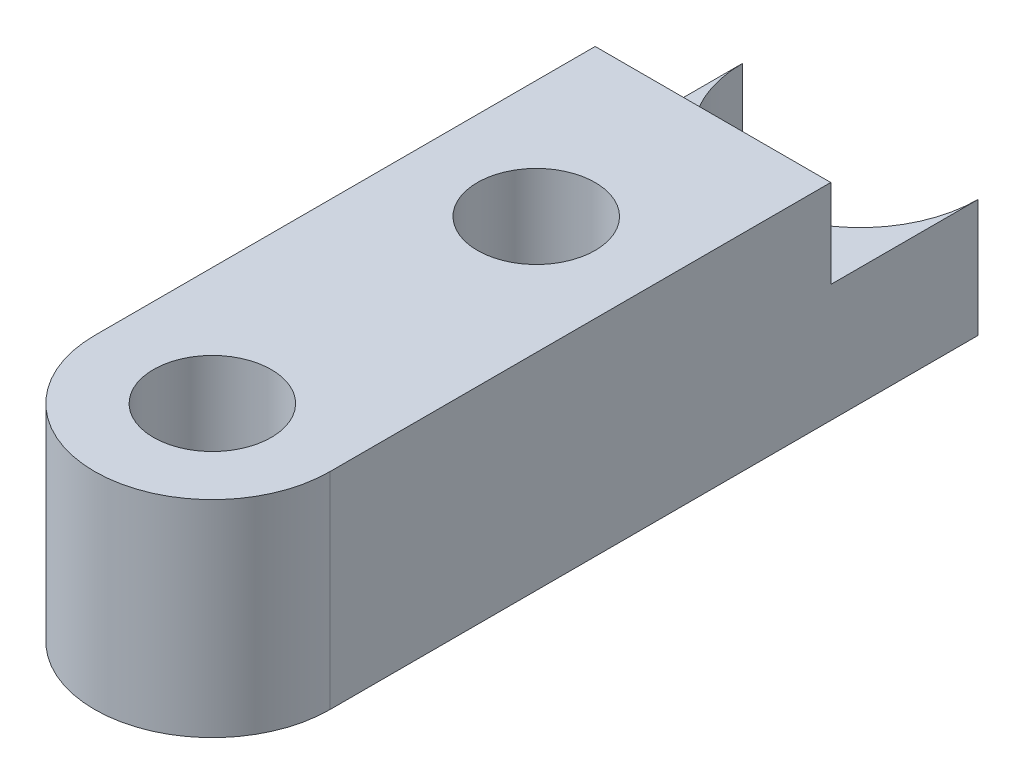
ISO-10303-21;
HEADER;
FILE_DESCRIPTION(('STEP AP214'),'2;1');
FILE_NAME('part.step','',(''),(''),'','','');
FILE_SCHEMA(('AUTOMOTIVE_DESIGN { 1 0 10303 214 1 1 1 1 }'));
ENDSEC;
DATA;
#1=APPLICATION_CONTEXT('core data for automotive mechanical design processes');
#2=APPLICATION_PROTOCOL_DEFINITION('international standard','automotive_design',2000,#1);
#3=PRODUCT_CONTEXT('',#1,'mechanical');
#4=PRODUCT('Part','Part','',(#3));
#5=PRODUCT_RELATED_PRODUCT_CATEGORY('part','',(#4));
#6=PRODUCT_DEFINITION_FORMATION('','',#4);
#7=PRODUCT_DEFINITION_CONTEXT('part definition',#1,'design');
#8=PRODUCT_DEFINITION('design','',#6,#7);
#9=PRODUCT_DEFINITION_SHAPE('','',#8);
#10=(LENGTH_UNIT() NAMED_UNIT(*) SI_UNIT(.MILLI.,.METRE.));
#11=(NAMED_UNIT(*) PLANE_ANGLE_UNIT() SI_UNIT($,.RADIAN.));
#12=(NAMED_UNIT(*) SI_UNIT($,.STERADIAN.) SOLID_ANGLE_UNIT());
#13=UNCERTAINTY_MEASURE_WITH_UNIT(LENGTH_MEASURE(1.E-05),#10,'distance_accuracy_value','');
#14=(GEOMETRIC_REPRESENTATION_CONTEXT(3) GLOBAL_UNCERTAINTY_ASSIGNED_CONTEXT((#13)) GLOBAL_UNIT_ASSIGNED_CONTEXT((#10,
#11,#12)) REPRESENTATION_CONTEXT('',''));
#15=CARTESIAN_POINT('',(0.,0.,0.));
#16=DIRECTION('',(0.,0.,1.));
#17=DIRECTION('',(1.,0.,0.));
#18=AXIS2_PLACEMENT_3D('',#15,#16,#17);
#19=CARTESIAN_POINT('',(-75.0118153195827,3.5,-1.3017355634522));
#20=DIRECTION('',(0.,-1.,0.));
#21=DIRECTION('',(0.,0.,-1.));
#22=AXIS2_PLACEMENT_3D('',#19,#20,#21);
#23=CYLINDRICAL_SURFACE('',#22,2.);
#24=CARTESIAN_POINT('',(-75.0118153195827,2.,-1.3017355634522));
#25=DIRECTION('',(0.,1.,0.));
#26=DIRECTION('',(0.,0.,1.));
#27=AXIS2_PLACEMENT_3D('',#24,#25,#26);
#28=CIRCLE('',#27,2.);
#29=CARTESIAN_POINT('',(-73.0118153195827,2.,-1.3017355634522));
#30=VERTEX_POINT('',#29);
#31=CARTESIAN_POINT('',(-77.0118153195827,2.,-1.3017355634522));
#32=VERTEX_POINT('',#31);
#33=EDGE_CURVE('E50',#30,#32,#28,.F.);
#34=ORIENTED_EDGE('',*,*,#33,.F.);
#35=DIRECTION('',(0.,-1.,0.));
#36=VECTOR('',#35,1.);
#37=CARTESIAN_POINT('',(-73.0118153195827,3.5,-1.3017355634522));
#38=LINE('',#37,#36);
#39=CARTESIAN_POINT('',(-73.0118153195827,0.,-1.3017355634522));
#40=VERTEX_POINT('',#39);
#41=EDGE_CURVE('E43',#30,#40,#38,.T.);
#42=ORIENTED_EDGE('',*,*,#41,.T.);
#43=CARTESIAN_POINT('',(-75.0118153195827,0.,-1.3017355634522));
#44=DIRECTION('',(0.,-1.,0.));
#45=DIRECTION('',(0.,0.,1.));
#46=AXIS2_PLACEMENT_3D('',#43,#44,#45);
#47=CIRCLE('',#46,2.);
#48=CARTESIAN_POINT('',(-77.0118153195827,0.,-1.3017355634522));
#49=VERTEX_POINT('',#48);
#50=EDGE_CURVE('E90',#40,#49,#47,.T.);
#51=ORIENTED_EDGE('',*,*,#50,.T.);
#52=DIRECTION('',(0.,-1.,0.));
#53=VECTOR('',#52,1.);
#54=CARTESIAN_POINT('',(-77.0118153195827,3.5,-1.3017355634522));
#55=LINE('',#54,#53);
#56=EDGE_CURVE('E84',#32,#49,#55,.T.);
#57=ORIENTED_EDGE('',*,*,#56,.F.);
#58=EDGE_LOOP('',(#34,#42,#51,#57));
#59=FACE_BOUND('',#58,.T.);
#60=ADVANCED_FACE('F35',(#59),#23,.F.);
#61=CARTESIAN_POINT('',(-75.0118153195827,3.5,9.6982644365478));
#62=DIRECTION('',(0.,1.,0.));
#63=DIRECTION('',(0.,0.,1.));
#64=AXIS2_PLACEMENT_3D('',#61,#62,#63);
#65=PLANE('',#64);
#66=DIRECTION('',(1.,0.,0.));
#67=VECTOR('',#66,1.);
#68=CARTESIAN_POINT('',(-77.0118153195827,3.5,1.1982644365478));
#69=LINE('',#68,#67);
#70=CARTESIAN_POINT('',(-77.0118153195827,3.5,1.1982644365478));
#71=VERTEX_POINT('',#70);
#72=CARTESIAN_POINT('',(-73.0118153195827,3.5,1.1982644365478));
#73=VERTEX_POINT('',#72);
#74=EDGE_CURVE('E141',#71,#73,#69,.T.);
#75=ORIENTED_EDGE('',*,*,#74,.F.);
#76=DIRECTION('',(0.,0.,1.));
#77=VECTOR('',#76,1.);
#78=CARTESIAN_POINT('',(-77.0118153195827,3.5,9.6982644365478));
#79=LINE('',#78,#77);
#80=CARTESIAN_POINT('',(-77.0118153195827,3.5,9.6982644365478));
#81=VERTEX_POINT('',#80);
#82=EDGE_CURVE('E59',#71,#81,#79,.T.);
#83=ORIENTED_EDGE('',*,*,#82,.T.);
#84=CARTESIAN_POINT('',(-75.0118153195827,3.5,9.6982644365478));
#85=DIRECTION('',(0.,1.,0.));
#86=DIRECTION('',(0.,0.,1.));
#87=AXIS2_PLACEMENT_3D('',#84,#85,#86);
#88=CIRCLE('',#87,2.);
#89=CARTESIAN_POINT('',(-73.0118153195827,3.5,9.6982644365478));
#90=VERTEX_POINT('',#89);
#91=EDGE_CURVE('E89',#81,#90,#88,.T.);
#92=ORIENTED_EDGE('',*,*,#91,.T.);
#93=DIRECTION('',(0.,0.,-1.));
#94=VECTOR('',#93,1.);
#95=CARTESIAN_POINT('',(-73.0118153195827,3.5,9.6982644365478));
#96=LINE('',#95,#94);
#97=EDGE_CURVE('E118',#90,#73,#96,.T.);
#98=ORIENTED_EDGE('',*,*,#97,.T.);
#99=EDGE_LOOP('',(#75,#83,#92,#98));
#100=FACE_BOUND('',#99,.T.);
#101=CARTESIAN_POINT('',(-75.0118153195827,3.5,9.6982644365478));
#102=DIRECTION('',(0.,1.,0.));
#103=DIRECTION('',(0.,0.,1.));
#104=AXIS2_PLACEMENT_3D('',#101,#102,#103);
#105=CIRCLE('',#104,0.999999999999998);
#106=CARTESIAN_POINT('',(-75.0118153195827,3.5,10.6982644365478));
#107=VERTEX_POINT('',#106);
#108=EDGE_CURVE('E101',#107,#107,#105,.T.);
#109=ORIENTED_EDGE('',*,*,#108,.F.);
#110=EDGE_LOOP('',(#109));
#111=FACE_BOUND('',#110,.T.);
#112=CARTESIAN_POINT('',(-75.0118153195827,3.5,4.1982644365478));
#113=DIRECTION('',(0.,1.,0.));
#114=DIRECTION('',(0.,0.,1.));
#115=AXIS2_PLACEMENT_3D('',#112,#113,#114);
#116=CIRCLE('',#115,0.999999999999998);
#117=CARTESIAN_POINT('',(-75.0118153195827,3.5,5.19826443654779));
#118=VERTEX_POINT('',#117);
#119=EDGE_CURVE('E127',#118,#118,#116,.T.);
#120=ORIENTED_EDGE('',*,*,#119,.F.);
#121=EDGE_LOOP('',(#120));
#122=FACE_BOUND('',#121,.T.);
#123=ADVANCED_FACE('F122',(#100,#111,#122),#65,.T.);
#124=CARTESIAN_POINT('',(-75.0118153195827,0.,9.6982644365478));
#125=DIRECTION('',(0.,1.,0.));
#126=DIRECTION('',(0.,0.,1.));
#127=AXIS2_PLACEMENT_3D('',#124,#125,#126);
#128=PLANE('',#127);
#129=CARTESIAN_POINT('',(-75.0118153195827,0.,9.6982644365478));
#130=DIRECTION('',(0.,1.,0.));
#131=DIRECTION('',(0.,0.,1.));
#132=AXIS2_PLACEMENT_3D('',#129,#130,#131);
#133=CIRCLE('',#132,2.);
#134=CARTESIAN_POINT('',(-77.0118153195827,0.,9.6982644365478));
#135=VERTEX_POINT('',#134);
#136=CARTESIAN_POINT('',(-73.0118153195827,0.,9.6982644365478));
#137=VERTEX_POINT('',#136);
#138=EDGE_CURVE('E95',#135,#137,#133,.T.);
#139=ORIENTED_EDGE('',*,*,#138,.F.);
#140=DIRECTION('',(0.,0.,1.));
#141=VECTOR('',#140,1.);
#142=CARTESIAN_POINT('',(-77.0118153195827,0.,9.6982644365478));
#143=LINE('',#142,#141);
#144=EDGE_CURVE('E78',#49,#135,#143,.T.);
#145=ORIENTED_EDGE('',*,*,#144,.F.);
#146=ORIENTED_EDGE('',*,*,#50,.F.);
#147=DIRECTION('',(0.,0.,-1.));
#148=VECTOR('',#147,1.);
#149=CARTESIAN_POINT('',(-73.0118153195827,0.,9.6982644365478));
#150=LINE('',#149,#148);
#151=EDGE_CURVE('E100',#137,#40,#150,.T.);
#152=ORIENTED_EDGE('',*,*,#151,.F.);
#153=EDGE_LOOP('',(#139,#145,#146,#152));
#154=FACE_BOUND('',#153,.T.);
#155=CARTESIAN_POINT('',(-75.0118153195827,0.,9.6982644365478));
#156=DIRECTION('',(0.,1.,0.));
#157=DIRECTION('',(0.,0.,1.));
#158=AXIS2_PLACEMENT_3D('',#155,#156,#157);
#159=CIRCLE('',#158,0.999999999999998);
#160=CARTESIAN_POINT('',(-75.0118153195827,0.,10.6982644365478));
#161=VERTEX_POINT('',#160);
#162=EDGE_CURVE('E105',#161,#161,#159,.T.);
#163=ORIENTED_EDGE('',*,*,#162,.T.);
#164=EDGE_LOOP('',(#163));
#165=FACE_BOUND('',#164,.T.);
#166=CARTESIAN_POINT('',(-75.0118153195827,0.,4.1982644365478));
#167=DIRECTION('',(0.,1.,0.));
#168=DIRECTION('',(0.,0.,1.));
#169=AXIS2_PLACEMENT_3D('',#166,#167,#168);
#170=CIRCLE('',#169,0.999999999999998);
#171=CARTESIAN_POINT('',(-75.0118153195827,0.,5.19826443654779));
#172=VERTEX_POINT('',#171);
#173=EDGE_CURVE('E129',#172,#172,#170,.T.);
#174=ORIENTED_EDGE('',*,*,#173,.T.);
#175=EDGE_LOOP('',(#174));
#176=FACE_BOUND('',#175,.T.);
#177=ADVANCED_FACE('F97',(#154,#165,#176),#128,.F.);
#178=CARTESIAN_POINT('',(-75.0118153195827,3.5,9.6982644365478));
#179=DIRECTION('',(0.,-1.,0.));
#180=DIRECTION('',(0.,0.,-1.));
#181=AXIS2_PLACEMENT_3D('',#178,#179,#180);
#182=CYLINDRICAL_SURFACE('',#181,2.);
#183=ORIENTED_EDGE('',*,*,#138,.T.);
#184=DIRECTION('',(0.,-1.,0.));
#185=VECTOR('',#184,1.);
#186=CARTESIAN_POINT('',(-73.0118153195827,3.5,9.6982644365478));
#187=LINE('',#186,#185);
#188=EDGE_CURVE('E11',#90,#137,#187,.T.);
#189=ORIENTED_EDGE('',*,*,#188,.F.);
#190=ORIENTED_EDGE('',*,*,#91,.F.);
#191=DIRECTION('',(0.,-1.,0.));
#192=VECTOR('',#191,1.);
#193=CARTESIAN_POINT('',(-77.0118153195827,3.5,9.6982644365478));
#194=LINE('',#193,#192);
#195=EDGE_CURVE('E81',#81,#135,#194,.T.);
#196=ORIENTED_EDGE('',*,*,#195,.T.);
#197=EDGE_LOOP('',(#183,#189,#190,#196));
#198=FACE_BOUND('',#197,.T.);
#199=ADVANCED_FACE('F37',(#198),#182,.T.);
#200=CARTESIAN_POINT('',(-73.0118153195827,3.5,9.6982644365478));
#201=DIRECTION('',(-1.,0.,0.));
#202=DIRECTION('',(0.,0.,1.));
#203=AXIS2_PLACEMENT_3D('',#200,#201,#202);
#204=PLANE('',#203);
#205=DIRECTION('',(0.,0.,-1.));
#206=VECTOR('',#205,1.);
#207=CARTESIAN_POINT('',(-73.0118153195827,2.,-1.3017355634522));
#208=LINE('',#207,#206);
#209=CARTESIAN_POINT('',(-73.0118153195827,2.,1.1982644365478));
#210=VERTEX_POINT('',#209);
#211=EDGE_CURVE('E139',#210,#30,#208,.T.);
#212=ORIENTED_EDGE('',*,*,#211,.F.);
#213=DIRECTION('',(0.,1.,0.));
#214=VECTOR('',#213,1.);
#215=CARTESIAN_POINT('',(-73.0118153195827,2.,1.1982644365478));
#216=LINE('',#215,#214);
#217=EDGE_CURVE('E121',#210,#73,#216,.T.);
#218=ORIENTED_EDGE('',*,*,#217,.T.);
#219=ORIENTED_EDGE('',*,*,#97,.F.);
#220=ORIENTED_EDGE('',*,*,#188,.T.);
#221=ORIENTED_EDGE('',*,*,#151,.T.);
#222=ORIENTED_EDGE('',*,*,#41,.F.);
#223=EDGE_LOOP('',(#212,#218,#219,#220,#221,#222));
#224=FACE_BOUND('',#223,.T.);
#225=ADVANCED_FACE('F115',(#224),#204,.F.);
#226=CARTESIAN_POINT('',(-77.0118153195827,3.5,9.6982644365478));
#227=DIRECTION('',(1.,0.,0.));
#228=DIRECTION('',(0.,0.,-1.));
#229=AXIS2_PLACEMENT_3D('',#226,#227,#228);
#230=PLANE('',#229);
#231=ORIENTED_EDGE('',*,*,#82,.F.);
#232=DIRECTION('',(0.,1.,0.));
#233=VECTOR('',#232,1.);
#234=CARTESIAN_POINT('',(-77.0118153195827,2.,1.1982644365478));
#235=LINE('',#234,#233);
#236=CARTESIAN_POINT('',(-77.0118153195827,2.,1.1982644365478));
#237=VERTEX_POINT('',#236);
#238=EDGE_CURVE('E136',#237,#71,#235,.T.);
#239=ORIENTED_EDGE('',*,*,#238,.F.);
#240=DIRECTION('',(0.,0.,1.));
#241=VECTOR('',#240,1.);
#242=CARTESIAN_POINT('',(-77.0118153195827,2.,-1.3017355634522));
#243=LINE('',#242,#241);
#244=EDGE_CURVE('E144',#32,#237,#243,.T.);
#245=ORIENTED_EDGE('',*,*,#244,.F.);
#246=ORIENTED_EDGE('',*,*,#56,.T.);
#247=ORIENTED_EDGE('',*,*,#144,.T.);
#248=ORIENTED_EDGE('',*,*,#195,.F.);
#249=EDGE_LOOP('',(#231,#239,#245,#246,#247,#248));
#250=FACE_BOUND('',#249,.T.);
#251=ADVANCED_FACE('F80',(#250),#230,.F.);
#252=CARTESIAN_POINT('',(-75.0118153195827,3.5,9.6982644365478));
#253=DIRECTION('',(0.,-1.,0.));
#254=DIRECTION('',(0.,0.,-1.));
#255=AXIS2_PLACEMENT_3D('',#252,#253,#254);
#256=CYLINDRICAL_SURFACE('',#255,0.999999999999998);
#257=ORIENTED_EDGE('',*,*,#108,.T.);
#258=EDGE_LOOP('',(#257));
#259=FACE_BOUND('',#258,.T.);
#260=ORIENTED_EDGE('',*,*,#162,.F.);
#261=EDGE_LOOP('',(#260));
#262=FACE_BOUND('',#261,.T.);
#263=ADVANCED_FACE('F182',(#259,#262),#256,.F.);
#264=CARTESIAN_POINT('',(-75.0118153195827,3.5,4.1982644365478));
#265=DIRECTION('',(0.,-1.,0.));
#266=DIRECTION('',(0.,0.,-1.));
#267=AXIS2_PLACEMENT_3D('',#264,#265,#266);
#268=CYLINDRICAL_SURFACE('',#267,0.999999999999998);
#269=ORIENTED_EDGE('',*,*,#119,.T.);
#270=EDGE_LOOP('',(#269));
#271=FACE_BOUND('',#270,.T.);
#272=ORIENTED_EDGE('',*,*,#173,.F.);
#273=EDGE_LOOP('',(#272));
#274=FACE_BOUND('',#273,.T.);
#275=ADVANCED_FACE('F166',(#271,#274),#268,.F.);
#276=CARTESIAN_POINT('',(0.,2.,0.));
#277=DIRECTION('',(0.,1.,0.));
#278=DIRECTION('',(0.,0.,1.));
#279=AXIS2_PLACEMENT_3D('',#276,#277,#278);
#280=PLANE('',#279);
#281=ORIENTED_EDGE('',*,*,#33,.T.);
#282=ORIENTED_EDGE('',*,*,#244,.T.);
#283=DIRECTION('',(1.,0.,0.));
#284=VECTOR('',#283,1.);
#285=CARTESIAN_POINT('',(-77.0118153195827,2.,1.1982644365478));
#286=LINE('',#285,#284);
#287=EDGE_CURVE('E146',#237,#210,#286,.T.);
#288=ORIENTED_EDGE('',*,*,#287,.T.);
#289=ORIENTED_EDGE('',*,*,#211,.T.);
#290=EDGE_LOOP('',(#281,#282,#288,#289));
#291=FACE_BOUND('',#290,.T.);
#292=ADVANCED_FACE('F151',(#291),#280,.T.);
#293=CARTESIAN_POINT('',(-77.0118153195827,2.,1.1982644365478));
#294=DIRECTION('',(0.,0.,1.));
#295=DIRECTION('',(1.,0.,0.));
#296=AXIS2_PLACEMENT_3D('',#293,#294,#295);
#297=PLANE('',#296);
#298=ORIENTED_EDGE('',*,*,#74,.T.);
#299=ORIENTED_EDGE('',*,*,#217,.F.);
#300=ORIENTED_EDGE('',*,*,#287,.F.);
#301=ORIENTED_EDGE('',*,*,#238,.T.);
#302=EDGE_LOOP('',(#298,#299,#300,#301));
#303=FACE_BOUND('',#302,.T.);
#304=ADVANCED_FACE('F157',(#303),#297,.F.);
#305=CLOSED_SHELL('',(#60,#123,#177,#199,#225,#251,#263,#275,#292,#304));
#306=MANIFOLD_SOLID_BREP('B2',#305);
#307=ADVANCED_BREP_SHAPE_REPRESENTATION('',(#18,#306),#14);
#308=SHAPE_DEFINITION_REPRESENTATION(#9,#307);
ENDSEC;
END-ISO-10303-21;
